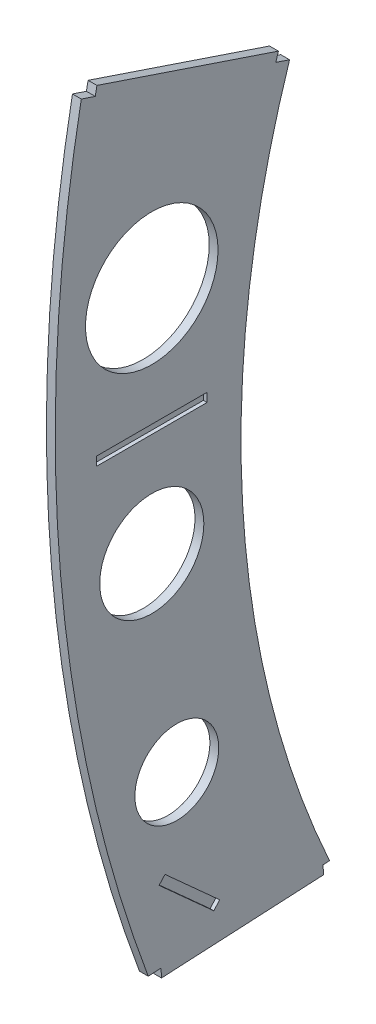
ISO-10303-21;
HEADER;
FILE_DESCRIPTION(('STEP AP214'),'2;1');
FILE_NAME('part.step','',(''),(''),'','','');
FILE_SCHEMA(('AUTOMOTIVE_DESIGN { 1 0 10303 214 1 1 1 1 }'));
ENDSEC;
DATA;
#1=APPLICATION_CONTEXT('core data for automotive mechanical design processes');
#2=APPLICATION_PROTOCOL_DEFINITION('international standard','automotive_design',2000,#1);
#3=PRODUCT_CONTEXT('',#1,'mechanical');
#4=PRODUCT('Part','Part','',(#3));
#5=PRODUCT_RELATED_PRODUCT_CATEGORY('part','',(#4));
#6=PRODUCT_DEFINITION_FORMATION('','',#4);
#7=PRODUCT_DEFINITION_CONTEXT('part definition',#1,'design');
#8=PRODUCT_DEFINITION('design','',#6,#7);
#9=PRODUCT_DEFINITION_SHAPE('','',#8);
#10=(LENGTH_UNIT() NAMED_UNIT(*) SI_UNIT(.MILLI.,.METRE.));
#11=(NAMED_UNIT(*) PLANE_ANGLE_UNIT() SI_UNIT($,.RADIAN.));
#12=(NAMED_UNIT(*) SI_UNIT($,.STERADIAN.) SOLID_ANGLE_UNIT());
#13=UNCERTAINTY_MEASURE_WITH_UNIT(LENGTH_MEASURE(1.E-05),#10,'distance_accuracy_value','');
#14=(GEOMETRIC_REPRESENTATION_CONTEXT(3) GLOBAL_UNCERTAINTY_ASSIGNED_CONTEXT((#13)) GLOBAL_UNIT_ASSIGNED_CONTEXT((#10,
#11,#12)) REPRESENTATION_CONTEXT('',''));
#15=CARTESIAN_POINT('',(0.,0.,0.));
#16=DIRECTION('',(0.,0.,1.));
#17=DIRECTION('',(1.,0.,0.));
#18=AXIS2_PLACEMENT_3D('',#15,#16,#17);
#19=CARTESIAN_POINT('',(7.,-980.120094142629,-110.473803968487));
#20=DIRECTION('',(0.,0.669721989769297,0.74261191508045));
#21=DIRECTION('',(0.,-0.74261191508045,0.669721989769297));
#22=AXIS2_PLACEMENT_3D('',#19,#20,#21);
#23=PLANE('',#22);
#24=DIRECTION('',(0.,0.742611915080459,-0.669721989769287));
#25=VECTOR('',#24,1.);
#26=CARTESIAN_POINT('',(7.,-989.031437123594,-102.437140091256));
#27=LINE('',#26,#25);
#28=CARTESIAN_POINT('',(7.,-989.031437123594,-102.437140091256));
#29=VERTEX_POINT('',#28);
#30=CARTESIAN_POINT('',(7.,-980.120094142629,-110.473803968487));
#31=VERTEX_POINT('',#30);
#32=EDGE_CURVE('E183',#29,#31,#27,.T.);
#33=ORIENTED_EDGE('',*,*,#32,.T.);
#34=DIRECTION('',(-1.,0.,0.));
#35=VECTOR('',#34,1.);
#36=CARTESIAN_POINT('',(7.,-980.120094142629,-110.473803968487));
#37=LINE('',#36,#35);
#38=CARTESIAN_POINT('',(12.,-980.120094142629,-110.473803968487));
#39=VERTEX_POINT('',#38);
#40=EDGE_CURVE('E169',#39,#31,#37,.T.);
#41=ORIENTED_EDGE('',*,*,#40,.F.);
#42=DIRECTION('',(0.,0.74261191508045,-0.669721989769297));
#43=VECTOR('',#42,1.);
#44=CARTESIAN_POINT('',(12.,-10.877783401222,-984.581633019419));
#45=LINE('',#44,#43);
#46=CARTESIAN_POINT('',(12.,-989.031437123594,-102.437140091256));
#47=VERTEX_POINT('',#46);
#48=EDGE_CURVE('E198',#47,#39,#45,.T.);
#49=ORIENTED_EDGE('',*,*,#48,.F.);
#50=DIRECTION('',(-1.,0.,0.));
#51=VECTOR('',#50,1.);
#52=CARTESIAN_POINT('',(7.,-989.031437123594,-102.437140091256));
#53=LINE('',#52,#51);
#54=EDGE_CURVE('E184',#47,#29,#53,.T.);
#55=ORIENTED_EDGE('',*,*,#54,.T.);
#56=EDGE_LOOP('',(#33,#41,#49,#55));
#57=FACE_BOUND('',#56,.T.);
#58=ADVANCED_FACE('F33',(#57),#23,.F.);
#59=CARTESIAN_POINT('',(7.,-989.031437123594,-102.437140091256));
#60=DIRECTION('',(0.,-0.742611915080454,0.669721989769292));
#61=DIRECTION('',(0.,-0.669721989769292,-0.742611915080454));
#62=AXIS2_PLACEMENT_3D('',#59,#60,#61);
#63=PLANE('',#62);
#64=DIRECTION('',(0.,0.669721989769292,0.742611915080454));
#65=VECTOR('',#64,1.);
#66=CARTESIAN_POINT('',(7.,-1056.00363610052,-176.698331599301));
#67=LINE('',#66,#65);
#68=CARTESIAN_POINT('',(7.,-1056.00363610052,-176.698331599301));
#69=VERTEX_POINT('',#68);
#70=EDGE_CURVE('E48',#69,#29,#67,.T.);
#71=ORIENTED_EDGE('',*,*,#70,.T.);
#72=ORIENTED_EDGE('',*,*,#54,.F.);
#73=DIRECTION('',(0.,0.669721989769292,0.742611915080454));
#74=VECTOR('',#73,1.);
#75=CARTESIAN_POINT('',(12.,-1499.71342124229,-668.699756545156));
#76=LINE('',#75,#74);
#77=CARTESIAN_POINT('',(12.,-1056.00363610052,-176.698331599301));
#78=VERTEX_POINT('',#77);
#79=EDGE_CURVE('E195',#78,#47,#76,.T.);
#80=ORIENTED_EDGE('',*,*,#79,.F.);
#81=DIRECTION('',(-1.,0.,0.));
#82=VECTOR('',#81,1.);
#83=CARTESIAN_POINT('',(7.,-1056.00363610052,-176.698331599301));
#84=LINE('',#83,#82);
#85=EDGE_CURVE('E223',#78,#69,#84,.T.);
#86=ORIENTED_EDGE('',*,*,#85,.T.);
#87=EDGE_LOOP('',(#71,#72,#80,#86));
#88=FACE_BOUND('',#87,.T.);
#89=ADVANCED_FACE('F408',(#88),#63,.F.);
#90=CARTESIAN_POINT('',(7.,-1047.09229311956,-184.734995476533));
#91=DIRECTION('',(0.,-0.66972198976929,-0.742611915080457));
#92=DIRECTION('',(0.,0.742611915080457,-0.66972198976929));
#93=AXIS2_PLACEMENT_3D('',#90,#91,#92);
#94=PLANE('',#93);
#95=DIRECTION('',(0.,-0.742611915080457,0.66972198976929));
#96=VECTOR('',#95,1.);
#97=CARTESIAN_POINT('',(7.,-1047.09229311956,-184.734995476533));
#98=LINE('',#97,#96);
#99=CARTESIAN_POINT('',(7.,-1047.09229311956,-184.734995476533));
#100=VERTEX_POINT('',#99);
#101=EDGE_CURVE('E56',#100,#69,#98,.T.);
#102=ORIENTED_EDGE('',*,*,#101,.T.);
#103=ORIENTED_EDGE('',*,*,#85,.F.);
#104=DIRECTION('',(0.,-0.742611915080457,0.66972198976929));
#105=VECTOR('',#104,1.);
#106=CARTESIAN_POINT('',(12.,-77.8499823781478,-1058.84282452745));
#107=LINE('',#106,#105);
#108=CARTESIAN_POINT('',(12.,-1047.09229311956,-184.734995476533));
#109=VERTEX_POINT('',#108);
#110=EDGE_CURVE('E186',#109,#78,#107,.T.);
#111=ORIENTED_EDGE('',*,*,#110,.F.);
#112=DIRECTION('',(-1.,0.,0.));
#113=VECTOR('',#112,1.);
#114=CARTESIAN_POINT('',(7.,-1047.09229311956,-184.734995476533));
#115=LINE('',#114,#113);
#116=EDGE_CURVE('E179',#109,#100,#115,.T.);
#117=ORIENTED_EDGE('',*,*,#116,.T.);
#118=EDGE_LOOP('',(#102,#103,#111,#117));
#119=FACE_BOUND('',#118,.T.);
#120=ADVANCED_FACE('F413',(#119),#94,.F.);
#121=CARTESIAN_POINT('',(7.,-1047.09229311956,-184.734995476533));
#122=DIRECTION('',(0.,0.742611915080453,-0.669721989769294));
#123=DIRECTION('',(0.,0.669721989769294,0.742611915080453));
#124=AXIS2_PLACEMENT_3D('',#121,#122,#123);
#125=PLANE('',#124);
#126=DIRECTION('',(0.,-0.669721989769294,-0.742611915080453));
#127=VECTOR('',#126,1.);
#128=CARTESIAN_POINT('',(7.,-980.120094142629,-110.473803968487));
#129=LINE('',#128,#127);
#130=EDGE_CURVE('E173',#31,#100,#129,.T.);
#131=ORIENTED_EDGE('',*,*,#130,.T.);
#132=ORIENTED_EDGE('',*,*,#116,.F.);
#133=DIRECTION('',(0.,-0.669721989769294,-0.742611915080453));
#134=VECTOR('',#133,1.);
#135=CARTESIAN_POINT('',(12.,-1490.80207826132,-676.736420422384));
#136=LINE('',#135,#134);
#137=EDGE_CURVE('E175',#39,#109,#136,.T.);
#138=ORIENTED_EDGE('',*,*,#137,.F.);
#139=ORIENTED_EDGE('',*,*,#40,.T.);
#140=EDGE_LOOP('',(#131,#132,#138,#139));
#141=FACE_BOUND('',#140,.T.);
#142=ADVANCED_FACE('F171',(#141),#125,.F.);
#143=CARTESIAN_POINT('',(7.,-441.731689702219,-167.514629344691));
#144=DIRECTION('',(0.,0.,-1.));
#145=DIRECTION('',(-1.,0.,0.));
#146=AXIS2_PLACEMENT_3D('',#143,#144,#145);
#147=PLANE('',#146);
#148=DIRECTION('',(0.,-1.,0.));
#149=VECTOR('',#148,1.);
#150=CARTESIAN_POINT('',(7.,-441.731689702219,-167.514629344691));
#151=LINE('',#150,#149);
#152=CARTESIAN_POINT('',(7.,-441.731689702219,-167.514629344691));
#153=VERTEX_POINT('',#152);
#154=CARTESIAN_POINT('',(7.,-453.731689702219,-167.514629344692));
#155=VERTEX_POINT('',#154);
#156=EDGE_CURVE('E203',#153,#155,#151,.T.);
#157=ORIENTED_EDGE('',*,*,#156,.T.);
#158=DIRECTION('',(-1.,0.,0.));
#159=VECTOR('',#158,1.);
#160=CARTESIAN_POINT('',(7.,-453.731689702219,-167.514629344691));
#161=LINE('',#160,#159);
#162=CARTESIAN_POINT('',(12.,-453.731689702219,-167.514629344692));
#163=VERTEX_POINT('',#162);
#164=EDGE_CURVE('E222',#163,#155,#161,.T.);
#165=ORIENTED_EDGE('',*,*,#164,.F.);
#166=DIRECTION('',(0.,-1.,0.));
#167=VECTOR('',#166,1.);
#168=CARTESIAN_POINT('',(12.,-521.559767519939,-167.514629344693));
#169=LINE('',#168,#167);
#170=CARTESIAN_POINT('',(12.,-441.731689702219,-167.514629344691));
#171=VERTEX_POINT('',#170);
#172=EDGE_CURVE('E210',#171,#163,#169,.T.);
#173=ORIENTED_EDGE('',*,*,#172,.F.);
#174=DIRECTION('',(-1.,0.,0.));
#175=VECTOR('',#174,1.);
#176=CARTESIAN_POINT('',(7.,-441.731689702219,-167.514629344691));
#177=LINE('',#176,#175);
#178=EDGE_CURVE('E226',#171,#153,#177,.T.);
#179=ORIENTED_EDGE('',*,*,#178,.T.);
#180=EDGE_LOOP('',(#157,#165,#173,#179));
#181=FACE_BOUND('',#180,.T.);
#182=ADVANCED_FACE('F422',(#181),#147,.F.);
#183=CARTESIAN_POINT('',(7.,-441.731689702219,-167.514629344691));
#184=DIRECTION('',(0.,1.,0.));
#185=DIRECTION('',(0.,0.,1.));
#186=AXIS2_PLACEMENT_3D('',#183,#184,#185);
#187=PLANE('',#186);
#188=DIRECTION('',(0.,0.,-1.));
#189=VECTOR('',#188,1.);
#190=CARTESIAN_POINT('',(7.,-441.731689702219,-17.5146293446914));
#191=LINE('',#190,#189);
#192=CARTESIAN_POINT('',(7.,-441.731689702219,-17.5146293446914));
#193=VERTEX_POINT('',#192);
#194=EDGE_CURVE('E201',#193,#153,#191,.T.);
#195=ORIENTED_EDGE('',*,*,#194,.T.);
#196=ORIENTED_EDGE('',*,*,#178,.F.);
#197=DIRECTION('',(0.,0.,-1.));
#198=VECTOR('',#197,1.);
#199=CARTESIAN_POINT('',(12.,-441.731689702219,-1550.84424947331));
#200=LINE('',#199,#198);
#201=CARTESIAN_POINT('',(12.,-441.731689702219,-17.5146293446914));
#202=VERTEX_POINT('',#201);
#203=EDGE_CURVE('E180',#202,#171,#200,.T.);
#204=ORIENTED_EDGE('',*,*,#203,.F.);
#205=DIRECTION('',(-1.,0.,0.));
#206=VECTOR('',#205,1.);
#207=CARTESIAN_POINT('',(7.,-441.731689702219,-17.5146293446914));
#208=LINE('',#207,#206);
#209=EDGE_CURVE('E230',#202,#193,#208,.T.);
#210=ORIENTED_EDGE('',*,*,#209,.T.);
#211=EDGE_LOOP('',(#195,#196,#204,#210));
#212=FACE_BOUND('',#211,.T.);
#213=ADVANCED_FACE('F418',(#212),#187,.F.);
#214=CARTESIAN_POINT('',(7.,-441.731689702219,-17.5146293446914));
#215=DIRECTION('',(0.,0.,1.));
#216=DIRECTION('',(1.,0.,0.));
#217=AXIS2_PLACEMENT_3D('',#214,#215,#216);
#218=PLANE('',#217);
#219=DIRECTION('',(0.,1.,0.));
#220=VECTOR('',#219,1.);
#221=CARTESIAN_POINT('',(7.,-453.731689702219,-17.5146293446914));
#222=LINE('',#221,#220);
#223=CARTESIAN_POINT('',(7.,-453.731689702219,-17.5146293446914));
#224=VERTEX_POINT('',#223);
#225=EDGE_CURVE('E208',#224,#193,#222,.T.);
#226=ORIENTED_EDGE('',*,*,#225,.T.);
#227=ORIENTED_EDGE('',*,*,#209,.F.);
#228=DIRECTION('',(0.,1.,0.));
#229=VECTOR('',#228,1.);
#230=CARTESIAN_POINT('',(12.,-521.559767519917,-17.5146293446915));
#231=LINE('',#230,#229);
#232=CARTESIAN_POINT('',(12.,-453.731689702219,-17.5146293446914));
#233=VERTEX_POINT('',#232);
#234=EDGE_CURVE('E216',#233,#202,#231,.T.);
#235=ORIENTED_EDGE('',*,*,#234,.F.);
#236=DIRECTION('',(-1.,0.,0.));
#237=VECTOR('',#236,1.);
#238=CARTESIAN_POINT('',(7.,-453.731689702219,-17.5146293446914));
#239=LINE('',#238,#237);
#240=EDGE_CURVE('E233',#233,#224,#239,.T.);
#241=ORIENTED_EDGE('',*,*,#240,.T.);
#242=EDGE_LOOP('',(#226,#227,#235,#241));
#243=FACE_BOUND('',#242,.T.);
#244=ADVANCED_FACE('F421',(#243),#218,.F.);
#245=CARTESIAN_POINT('',(7.,-453.731689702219,-167.514629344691));
#246=DIRECTION('',(0.,-1.,0.));
#247=DIRECTION('',(0.,0.,-1.));
#248=AXIS2_PLACEMENT_3D('',#245,#246,#247);
#249=PLANE('',#248);
#250=DIRECTION('',(0.,0.,1.));
#251=VECTOR('',#250,1.);
#252=CARTESIAN_POINT('',(7.,-453.731689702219,-167.514629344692));
#253=LINE('',#252,#251);
#254=EDGE_CURVE('E206',#155,#224,#253,.T.);
#255=ORIENTED_EDGE('',*,*,#254,.T.);
#256=ORIENTED_EDGE('',*,*,#240,.F.);
#257=DIRECTION('',(0.,0.,1.));
#258=VECTOR('',#257,1.);
#259=CARTESIAN_POINT('',(12.,-453.731689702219,-1550.84424947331));
#260=LINE('',#259,#258);
#261=EDGE_CURVE('E213',#163,#233,#260,.T.);
#262=ORIENTED_EDGE('',*,*,#261,.F.);
#263=ORIENTED_EDGE('',*,*,#164,.T.);
#264=EDGE_LOOP('',(#255,#256,#262,#263));
#265=FACE_BOUND('',#264,.T.);
#266=ADVANCED_FACE('F426',(#265),#249,.F.);
#267=CARTESIAN_POINT('',(12.,-386.92843178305,-1973.74746697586));
#268=DIRECTION('',(-1.,0.,0.));
#269=DIRECTION('',(0.,0.,1.));
#270=AXIS2_PLACEMENT_3D('',#267,#268,#269);
#271=CYLINDRICAL_SURFACE('',#270,2012.30376542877);
#272=DIRECTION('',(-1.,0.,0.));
#273=VECTOR('',#272,1.);
#274=CARTESIAN_POINT('',(25.,-1088.46656554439,-87.6905507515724));
#275=LINE('',#274,#273);
#276=CARTESIAN_POINT('',(12.,-1088.46656554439,-87.6905507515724));
#277=VERTEX_POINT('',#276);
#278=CARTESIAN_POINT('',(0.,-1088.46656554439,-87.6905507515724));
#279=VERTEX_POINT('',#278);
#280=EDGE_CURVE('E243',#277,#279,#275,.T.);
#281=ORIENTED_EDGE('',*,*,#280,.F.);
#282=CARTESIAN_POINT('',(12.,-386.92843178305,-1973.74746697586));
#283=DIRECTION('',(1.,0.,0.));
#284=DIRECTION('',(0.,0.,-1.));
#285=AXIS2_PLACEMENT_3D('',#282,#283,#284);
#286=CIRCLE('',#285,2012.30376542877);
#287=CARTESIAN_POINT('',(12.,-11.4650132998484,3.21830555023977));
#288=VERTEX_POINT('',#287);
#289=EDGE_CURVE('E285',#288,#277,#286,.T.);
#290=ORIENTED_EDGE('',*,*,#289,.F.);
#291=DIRECTION('',(-1.,0.,0.));
#292=VECTOR('',#291,1.);
#293=CARTESIAN_POINT('',(12.,-11.4650132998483,3.21830555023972));
#294=LINE('',#293,#292);
#295=CARTESIAN_POINT('',(0.,-11.4650132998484,3.21830555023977));
#296=VERTEX_POINT('',#295);
#297=EDGE_CURVE('E283',#288,#296,#294,.T.);
#298=ORIENTED_EDGE('',*,*,#297,.T.);
#299=CARTESIAN_POINT('',(0.,-386.92843178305,-1973.74746697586));
#300=DIRECTION('',(1.,0.,0.));
#301=DIRECTION('',(0.,0.,-1.));
#302=AXIS2_PLACEMENT_3D('',#299,#300,#301);
#303=CIRCLE('',#302,2012.30376542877);
#304=EDGE_CURVE('E280',#296,#279,#303,.T.);
#305=ORIENTED_EDGE('',*,*,#304,.T.);
#306=EDGE_LOOP('',(#281,#290,#298,#305));
#307=FACE_BOUND('',#306,.T.);
#308=ADVANCED_FACE('F387',(#307),#271,.T.);
#309=CARTESIAN_POINT('',(12.,-521.559767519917,-1550.84424947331));
#310=DIRECTION('',(-1.,0.,0.));
#311=DIRECTION('',(0.,0.,1.));
#312=AXIS2_PLACEMENT_3D('',#309,#310,#311);
#313=PLANE('',#312);
#314=ORIENTED_EDGE('',*,*,#48,.T.);
#315=ORIENTED_EDGE('',*,*,#137,.T.);
#316=ORIENTED_EDGE('',*,*,#110,.T.);
#317=ORIENTED_EDGE('',*,*,#79,.T.);
#318=EDGE_LOOP('',(#314,#315,#316,#317));
#319=FACE_BOUND('',#318,.T.);
#320=ORIENTED_EDGE('',*,*,#234,.T.);
#321=ORIENTED_EDGE('',*,*,#203,.T.);
#322=ORIENTED_EDGE('',*,*,#172,.T.);
#323=ORIENTED_EDGE('',*,*,#261,.T.);
#324=EDGE_LOOP('',(#320,#321,#322,#323));
#325=FACE_BOUND('',#324,.T.);
#326=CARTESIAN_POINT('',(12.,-281.747595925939,-92.5146293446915));
#327=DIRECTION('',(1.,0.,0.));
#328=DIRECTION('',(0.,0.,-1.));
#329=AXIS2_PLACEMENT_3D('',#326,#327,#328);
#330=CIRCLE('',#329,89.9840937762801);
#331=CARTESIAN_POINT('',(12.,-281.747595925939,-182.498723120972));
#332=VERTEX_POINT('',#331);
#333=EDGE_CURVE('E310',#332,#332,#330,.T.);
#334=ORIENTED_EDGE('',*,*,#333,.F.);
#335=EDGE_LOOP('',(#334));
#336=FACE_BOUND('',#335,.T.);
#337=CARTESIAN_POINT('',(12.,-593.878965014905,-92.5146293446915));
#338=DIRECTION('',(1.,0.,0.));
#339=DIRECTION('',(0.,0.,-1.));
#340=AXIS2_PLACEMENT_3D('',#337,#338,#339);
#341=CIRCLE('',#340,70.6940300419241);
#342=CARTESIAN_POINT('',(12.,-593.878965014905,-163.208659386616));
#343=VERTEX_POINT('',#342);
#344=EDGE_CURVE('E306',#343,#343,#341,.T.);
#345=ORIENTED_EDGE('',*,*,#344,.F.);
#346=EDGE_LOOP('',(#345));
#347=FACE_BOUND('',#346,.T.);
#348=CARTESIAN_POINT('',(12.,-867.825114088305,-126.500771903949));
#349=DIRECTION('',(1.,0.,0.));
#350=DIRECTION('',(0.,0.,-1.));
#351=AXIS2_PLACEMENT_3D('',#348,#349,#350);
#352=CIRCLE('',#351,56.9336513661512);
#353=CARTESIAN_POINT('',(12.,-867.825114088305,-183.4344232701));
#354=VERTEX_POINT('',#353);
#355=EDGE_CURVE('E302',#354,#354,#352,.T.);
#356=ORIENTED_EDGE('',*,*,#355,.F.);
#357=EDGE_LOOP('',(#356));
#358=FACE_BOUND('',#357,.T.);
#359=DIRECTION('',(0.,-0.0515409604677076,0.998670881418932));
#360=VECTOR('',#359,1.);
#361=CARTESIAN_POINT('',(12.,-1011.6484793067,-1576.1375101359));
#362=LINE('',#361,#360);
#363=CARTESIAN_POINT('',(12.,-1087.56789574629,-105.103407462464));
#364=VERTEX_POINT('',#363);
#365=EDGE_CURVE('E248',#364,#277,#362,.T.);
#366=ORIENTED_EDGE('',*,*,#365,.F.);
#367=DIRECTION('',(0.,0.998670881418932,0.0515409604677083));
#368=VECTOR('',#367,1.);
#369=CARTESIAN_POINT('',(12.,-597.479183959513,-79.8101467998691));
#370=LINE('',#369,#368);
#371=CARTESIAN_POINT('',(12.,-1099.5678957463,-105.72272213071));
#372=VERTEX_POINT('',#371);
#373=EDGE_CURVE('E245',#372,#364,#370,.T.);
#374=ORIENTED_EDGE('',*,*,#373,.F.);
#375=DIRECTION('',(0.,0.0515409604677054,-0.998670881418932));
#376=VECTOR('',#375,1.);
#377=CARTESIAN_POINT('',(12.,-1023.6484793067,-1576.75682480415));
#378=LINE('',#377,#376);
#379=CARTESIAN_POINT('',(12.,-1088.21379349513,-325.722722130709));
#380=VERTEX_POINT('',#379);
#381=EDGE_CURVE('E268',#372,#380,#378,.T.);
#382=ORIENTED_EDGE('',*,*,#381,.T.);
#383=DIRECTION('',(0.,0.998670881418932,0.0515409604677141));
#384=VECTOR('',#383,1.);
#385=CARTESIAN_POINT('',(12.,-586.125081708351,-299.810146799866));
#386=LINE('',#385,#384);
#387=CARTESIAN_POINT('',(12.,-1076.21379349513,-325.103407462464));
#388=VERTEX_POINT('',#387);
#389=EDGE_CURVE('E259',#380,#388,#386,.T.);
#390=ORIENTED_EDGE('',*,*,#389,.T.);
#391=DIRECTION('',(0.,0.0515409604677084,-0.998670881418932));
#392=VECTOR('',#391,1.);
#393=CARTESIAN_POINT('',(12.,-1011.6484793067,-1576.1375101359));
#394=LINE('',#393,#392);
#395=CARTESIAN_POINT('',(12.,-1075.75972176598,-333.901617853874));
#396=VERTEX_POINT('',#395);
#397=EDGE_CURVE('E263',#388,#396,#394,.T.);
#398=ORIENTED_EDGE('',*,*,#397,.T.);
#399=CARTESIAN_POINT('',(12.,-521.559767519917,-1550.84424947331));
#400=DIRECTION('',(-1.,0.,0.));
#401=DIRECTION('',(0.,0.,1.));
#402=AXIS2_PLACEMENT_3D('',#399,#400,#401);
#403=CIRCLE('',#402,1337.19368751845);
#404=CARTESIAN_POINT('',(12.,-106.69780076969,-279.633603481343));
#405=VERTEX_POINT('',#404);
#406=EDGE_CURVE('E314',#396,#405,#403,.T.);
#407=ORIENTED_EDGE('',*,*,#406,.T.);
#408=DIRECTION('',(0.,-0.318763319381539,-0.947834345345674));
#409=VECTOR('',#408,1.);
#410=CARTESIAN_POINT('',(12.,-100.416845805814,-260.95734911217));
#411=LINE('',#410,#409);
#412=CARTESIAN_POINT('',(12.,-100.416845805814,-260.95734911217));
#413=VERTEX_POINT('',#412);
#414=EDGE_CURVE('E279',#413,#405,#411,.T.);
#415=ORIENTED_EDGE('',*,*,#414,.F.);
#416=DIRECTION('',(0.,-0.956720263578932,0.291009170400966));
#417=VECTOR('',#416,1.);
#418=CARTESIAN_POINT('',(12.,-88.9362026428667,-264.449459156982));
#419=LINE('',#418,#417);
#420=CARTESIAN_POINT('',(12.,-88.9362026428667,-264.449459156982));
#421=VERTEX_POINT('',#420);
#422=EDGE_CURVE('E331',#421,#413,#419,.T.);
#423=ORIENTED_EDGE('',*,*,#422,.F.);
#424=DIRECTION('',(0.,0.318763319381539,0.947834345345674));
#425=VECTOR('',#424,1.);
#426=CARTESIAN_POINT('',(12.,0.317526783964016,0.944157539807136));
#427=LINE('',#426,#425);
#428=CARTESIAN_POINT('',(12.,-6.05773960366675,-18.0125293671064));
#429=VERTEX_POINT('',#428);
#430=EDGE_CURVE('E289',#421,#429,#427,.T.);
#431=ORIENTED_EDGE('',*,*,#430,.T.);
#432=DIRECTION('',(0.,0.981878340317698,-0.189512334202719));
#433=VECTOR('',#432,1.);
#434=CARTESIAN_POINT('',(12.,-6.05773960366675,-18.0125293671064));
#435=LINE('',#434,#433);
#436=CARTESIAN_POINT('',(12.,-17.8402796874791,-15.7383813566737));
#437=VERTEX_POINT('',#436);
#438=EDGE_CURVE('E275',#437,#429,#435,.T.);
#439=ORIENTED_EDGE('',*,*,#438,.F.);
#440=DIRECTION('',(0.,-0.318763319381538,-0.947834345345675));
#441=VECTOR('',#440,1.);
#442=CARTESIAN_POINT('',(12.,-17.8402796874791,-15.7383813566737));
#443=LINE('',#442,#441);
#444=EDGE_CURVE('E290',#288,#437,#443,.T.);
#445=ORIENTED_EDGE('',*,*,#444,.F.);
#446=ORIENTED_EDGE('',*,*,#289,.T.);
#447=EDGE_LOOP('',(#366,#374,#382,#390,#398,#407,#415,#423,#431,#439,#445,#446));
#448=FACE_BOUND('',#447,.T.);
#449=ADVANCED_FACE('F363',(#319,#325,#336,#347,#358,#448),#313,.F.);
#450=CARTESIAN_POINT('',(0.,-521.559767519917,-1550.84424947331));
#451=DIRECTION('',(-1.,0.,0.));
#452=DIRECTION('',(0.,0.,1.));
#453=AXIS2_PLACEMENT_3D('',#450,#451,#452);
#454=PLANE('',#453);
#455=CARTESIAN_POINT('',(0.,-867.825114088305,-126.500771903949));
#456=DIRECTION('',(-1.,0.,0.));
#457=DIRECTION('',(0.,0.,1.));
#458=AXIS2_PLACEMENT_3D('',#455,#456,#457);
#459=CIRCLE('',#458,56.9336513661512);
#460=CARTESIAN_POINT('',(0.,-867.825114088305,-69.5671205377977));
#461=VERTEX_POINT('',#460);
#462=EDGE_CURVE('E305',#461,#461,#459,.T.);
#463=ORIENTED_EDGE('',*,*,#462,.F.);
#464=EDGE_LOOP('',(#463));
#465=FACE_BOUND('',#464,.T.);
#466=CARTESIAN_POINT('',(0.,-593.878965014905,-92.5146293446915));
#467=DIRECTION('',(-1.,0.,0.));
#468=DIRECTION('',(0.,0.,1.));
#469=AXIS2_PLACEMENT_3D('',#466,#467,#468);
#470=CIRCLE('',#469,70.6940300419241);
#471=CARTESIAN_POINT('',(0.,-593.878965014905,-21.8205993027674));
#472=VERTEX_POINT('',#471);
#473=EDGE_CURVE('E309',#472,#472,#470,.T.);
#474=ORIENTED_EDGE('',*,*,#473,.F.);
#475=EDGE_LOOP('',(#474));
#476=FACE_BOUND('',#475,.T.);
#477=CARTESIAN_POINT('',(0.,-281.747595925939,-92.5146293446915));
#478=DIRECTION('',(-1.,0.,0.));
#479=DIRECTION('',(0.,0.,1.));
#480=AXIS2_PLACEMENT_3D('',#477,#478,#479);
#481=CIRCLE('',#480,89.9840937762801);
#482=CARTESIAN_POINT('',(0.,-281.747595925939,-2.53053556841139));
#483=VERTEX_POINT('',#482);
#484=EDGE_CURVE('E288',#483,#483,#481,.T.);
#485=ORIENTED_EDGE('',*,*,#484,.F.);
#486=EDGE_LOOP('',(#485));
#487=FACE_BOUND('',#486,.T.);
#488=DIRECTION('',(0.,0.998670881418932,0.0515409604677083));
#489=VECTOR('',#488,1.);
#490=CARTESIAN_POINT('',(0.,2.52083841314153,-48.8444122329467));
#491=LINE('',#490,#489);
#492=CARTESIAN_POINT('',(0.,-1099.5678957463,-105.72272213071));
#493=VERTEX_POINT('',#492);
#494=CARTESIAN_POINT('',(0.,-1087.56789574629,-105.103407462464));
#495=VERTEX_POINT('',#494);
#496=EDGE_CURVE('E239',#493,#495,#491,.T.);
#497=ORIENTED_EDGE('',*,*,#496,.T.);
#498=DIRECTION('',(0.,-0.0515409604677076,0.998670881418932));
#499=VECTOR('',#498,1.);
#500=CARTESIAN_POINT('',(0.,-1090.08873415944,-56.2589952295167));
#501=LINE('',#500,#499);
#502=EDGE_CURVE('E229',#495,#279,#501,.T.);
#503=ORIENTED_EDGE('',*,*,#502,.T.);
#504=ORIENTED_EDGE('',*,*,#304,.F.);
#505=DIRECTION('',(0.,0.318763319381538,0.947834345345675));
#506=VECTOR('',#505,1.);
#507=CARTESIAN_POINT('',(0.,-532.832182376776,-1547.05325751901));
#508=LINE('',#507,#506);
#509=CARTESIAN_POINT('',(0.,-17.840279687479,-15.7383813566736));
#510=VERTEX_POINT('',#509);
#511=EDGE_CURVE('E294',#510,#296,#508,.T.);
#512=ORIENTED_EDGE('',*,*,#511,.F.);
#513=DIRECTION('',(0.,-0.981878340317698,0.189512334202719));
#514=VECTOR('',#513,1.);
#515=CARTESIAN_POINT('',(0.,-217.819204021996,22.8595499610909));
#516=LINE('',#515,#514);
#517=CARTESIAN_POINT('',(0.,-6.05773960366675,-18.0125293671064));
#518=VERTEX_POINT('',#517);
#519=EDGE_CURVE('E293',#518,#510,#516,.T.);
#520=ORIENTED_EDGE('',*,*,#519,.F.);
#521=DIRECTION('',(0.,0.318763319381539,0.947834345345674));
#522=VECTOR('',#521,1.);
#523=CARTESIAN_POINT('',(0.,0.317526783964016,0.944157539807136));
#524=LINE('',#523,#522);
#525=CARTESIAN_POINT('',(0.,-88.9362026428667,-264.449459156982));
#526=VERTEX_POINT('',#525);
#527=EDGE_CURVE('E300',#526,#518,#524,.T.);
#528=ORIENTED_EDGE('',*,*,#527,.F.);
#529=DIRECTION('',(0.,0.956720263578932,-0.291009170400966));
#530=VECTOR('',#529,1.);
#531=CARTESIAN_POINT('',(0.,-126.771667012,-252.940904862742));
#532=LINE('',#531,#530);
#533=CARTESIAN_POINT('',(0.,-100.416845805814,-260.95734911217));
#534=VERTEX_POINT('',#533);
#535=EDGE_CURVE('E276',#534,#526,#532,.T.);
#536=ORIENTED_EDGE('',*,*,#535,.F.);
#537=DIRECTION('',(0.,0.318763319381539,0.947834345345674));
#538=VECTOR('',#537,1.);
#539=CARTESIAN_POINT('',(0.,-532.928949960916,-1547.02071390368));
#540=LINE('',#539,#538);
#541=CARTESIAN_POINT('',(0.,-106.69780076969,-279.633603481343));
#542=VERTEX_POINT('',#541);
#543=EDGE_CURVE('E271',#542,#534,#540,.T.);
#544=ORIENTED_EDGE('',*,*,#543,.F.);
#545=CARTESIAN_POINT('',(0.,-521.559767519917,-1550.84424947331));
#546=DIRECTION('',(-1.,0.,0.));
#547=DIRECTION('',(0.,0.,1.));
#548=AXIS2_PLACEMENT_3D('',#545,#546,#547);
#549=CIRCLE('',#548,1337.19368751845);
#550=CARTESIAN_POINT('',(0.,-1075.75972176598,-333.901617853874));
#551=VERTEX_POINT('',#550);
#552=EDGE_CURVE('E270',#551,#542,#549,.T.);
#553=ORIENTED_EDGE('',*,*,#552,.F.);
#554=DIRECTION('',(0.,0.0515409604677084,-0.998670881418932));
#555=VECTOR('',#554,1.);
#556=CARTESIAN_POINT('',(0.,-1090.08873415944,-56.2589952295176));
#557=LINE('',#556,#555);
#558=CARTESIAN_POINT('',(0.,-1076.21379349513,-325.103407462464));
#559=VERTEX_POINT('',#558);
#560=EDGE_CURVE('E253',#559,#551,#557,.T.);
#561=ORIENTED_EDGE('',*,*,#560,.F.);
#562=DIRECTION('',(0.,0.998670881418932,0.0515409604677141));
#563=VECTOR('',#562,1.);
#564=CARTESIAN_POINT('',(0.,13.874940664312,-268.84441223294));
#565=LINE('',#564,#563);
#566=CARTESIAN_POINT('',(0.,-1088.21379349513,-325.72272213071));
#567=VERTEX_POINT('',#566);
#568=EDGE_CURVE('E250',#567,#559,#565,.T.);
#569=ORIENTED_EDGE('',*,*,#568,.F.);
#570=DIRECTION('',(0.,0.0515409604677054,-0.998670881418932));
#571=VECTOR('',#570,1.);
#572=CARTESIAN_POINT('',(0.,-1087.51191864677,-339.322429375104));
#573=LINE('',#572,#571);
#574=EDGE_CURVE('E266',#493,#567,#573,.T.);
#575=ORIENTED_EDGE('',*,*,#574,.F.);
#576=EDGE_LOOP('',(#497,#503,#504,#512,#520,#528,#536,#544,#553,#561,#569,#575));
#577=FACE_BOUND('',#576,.T.);
#578=ADVANCED_FACE('F352',(#465,#476,#487,#577),#454,.T.);
#579=CARTESIAN_POINT('',(25.,-1087.51191864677,-339.322429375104));
#580=DIRECTION('',(0.,0.998670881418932,0.0515409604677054));
#581=DIRECTION('',(0.,-0.0515409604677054,0.998670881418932));
#582=AXIS2_PLACEMENT_3D('',#579,#580,#581);
#583=PLANE('',#582);
#584=DIRECTION('',(1.,0.,0.));
#585=VECTOR('',#584,1.);
#586=CARTESIAN_POINT('',(25.,-1099.5678957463,-105.72272213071));
#587=LINE('',#586,#585);
#588=EDGE_CURVE('E11',#493,#372,#587,.T.);
#589=ORIENTED_EDGE('',*,*,#588,.F.);
#590=ORIENTED_EDGE('',*,*,#574,.T.);
#591=DIRECTION('',(1.,0.,0.));
#592=VECTOR('',#591,1.);
#593=CARTESIAN_POINT('',(25.,-1088.21379349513,-325.72272213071));
#594=LINE('',#593,#592);
#595=EDGE_CURVE('E41',#567,#380,#594,.T.);
#596=ORIENTED_EDGE('',*,*,#595,.T.);
#597=ORIENTED_EDGE('',*,*,#381,.F.);
#598=EDGE_LOOP('',(#589,#590,#596,#597));
#599=FACE_BOUND('',#598,.T.);
#600=ADVANCED_FACE('F343',(#599),#583,.F.);
#601=CARTESIAN_POINT('',(12.,-521.559767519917,-1550.84424947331));
#602=DIRECTION('',(-1.,0.,0.));
#603=DIRECTION('',(0.,0.,1.));
#604=AXIS2_PLACEMENT_3D('',#601,#602,#603);
#605=CYLINDRICAL_SURFACE('',#604,1337.19368751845);
#606=ORIENTED_EDGE('',*,*,#406,.F.);
#607=DIRECTION('',(-1.,0.,0.));
#608=VECTOR('',#607,1.);
#609=CARTESIAN_POINT('',(25.,-1075.75972176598,-333.901617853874));
#610=LINE('',#609,#608);
#611=EDGE_CURVE('E256',#396,#551,#610,.T.);
#612=ORIENTED_EDGE('',*,*,#611,.T.);
#613=ORIENTED_EDGE('',*,*,#552,.T.);
#614=DIRECTION('',(-1.,0.,0.));
#615=VECTOR('',#614,1.);
#616=CARTESIAN_POINT('',(12.,-106.69780076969,-279.633603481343));
#617=LINE('',#616,#615);
#618=EDGE_CURVE('E316',#542,#405,#617,.F.);
#619=ORIENTED_EDGE('',*,*,#618,.T.);
#620=EDGE_LOOP('',(#606,#612,#613,#619));
#621=FACE_BOUND('',#620,.T.);
#622=ADVANCED_FACE('F35',(#621),#605,.F.);
#623=CARTESIAN_POINT('',(12.,0.317526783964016,0.944157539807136));
#624=DIRECTION('',(0.,-0.947834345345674,0.318763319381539));
#625=DIRECTION('',(0.,-0.318763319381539,-0.947834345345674));
#626=AXIS2_PLACEMENT_3D('',#623,#624,#625);
#627=PLANE('',#626);
#628=ORIENTED_EDGE('',*,*,#430,.F.);
#629=DIRECTION('',(1.,0.,0.));
#630=VECTOR('',#629,1.);
#631=CARTESIAN_POINT('',(-2.,-88.9362026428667,-264.449459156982));
#632=LINE('',#631,#630);
#633=EDGE_CURVE('E278',#526,#421,#632,.T.);
#634=ORIENTED_EDGE('',*,*,#633,.F.);
#635=ORIENTED_EDGE('',*,*,#527,.T.);
#636=DIRECTION('',(1.,0.,0.));
#637=VECTOR('',#636,1.);
#638=CARTESIAN_POINT('',(-2.,-6.05773960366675,-18.0125293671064));
#639=LINE('',#638,#637);
#640=EDGE_CURVE('E284',#518,#429,#639,.T.);
#641=ORIENTED_EDGE('',*,*,#640,.T.);
#642=EDGE_LOOP('',(#628,#634,#635,#641));
#643=FACE_BOUND('',#642,.T.);
#644=ADVANCED_FACE('F374',(#643),#627,.F.);
#645=CARTESIAN_POINT('',(-2.,-281.747595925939,-92.5146293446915));
#646=DIRECTION('',(1.,0.,0.));
#647=DIRECTION('',(0.,0.,-1.));
#648=AXIS2_PLACEMENT_3D('',#645,#646,#647);
#649=CYLINDRICAL_SURFACE('',#648,89.9840937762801);
#650=ORIENTED_EDGE('',*,*,#484,.T.);
#651=EDGE_LOOP('',(#650));
#652=FACE_BOUND('',#651,.T.);
#653=ORIENTED_EDGE('',*,*,#333,.T.);
#654=EDGE_LOOP('',(#653));
#655=FACE_BOUND('',#654,.T.);
#656=ADVANCED_FACE('F463',(#652,#655),#649,.F.);
#657=CARTESIAN_POINT('',(-2.,-593.878965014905,-92.5146293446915));
#658=DIRECTION('',(1.,0.,0.));
#659=DIRECTION('',(0.,0.,-1.));
#660=AXIS2_PLACEMENT_3D('',#657,#658,#659);
#661=CYLINDRICAL_SURFACE('',#660,70.6940300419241);
#662=ORIENTED_EDGE('',*,*,#473,.T.);
#663=EDGE_LOOP('',(#662));
#664=FACE_BOUND('',#663,.T.);
#665=ORIENTED_EDGE('',*,*,#344,.T.);
#666=EDGE_LOOP('',(#665));
#667=FACE_BOUND('',#666,.T.);
#668=ADVANCED_FACE('F455',(#664,#667),#661,.F.);
#669=CARTESIAN_POINT('',(-2.,-867.825114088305,-126.500771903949));
#670=DIRECTION('',(1.,0.,0.));
#671=DIRECTION('',(0.,0.,-1.));
#672=AXIS2_PLACEMENT_3D('',#669,#670,#671);
#673=CYLINDRICAL_SURFACE('',#672,56.9336513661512);
#674=ORIENTED_EDGE('',*,*,#462,.T.);
#675=EDGE_LOOP('',(#674));
#676=FACE_BOUND('',#675,.T.);
#677=ORIENTED_EDGE('',*,*,#355,.T.);
#678=EDGE_LOOP('',(#677));
#679=FACE_BOUND('',#678,.T.);
#680=ADVANCED_FACE('F453',(#676,#679),#673,.F.);
#681=CARTESIAN_POINT('',(-2.,-17.8402796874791,-15.7383813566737));
#682=DIRECTION('',(0.,-0.947834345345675,0.318763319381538));
#683=DIRECTION('',(0.,-0.318763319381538,-0.947834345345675));
#684=AXIS2_PLACEMENT_3D('',#681,#682,#683);
#685=PLANE('',#684);
#686=ORIENTED_EDGE('',*,*,#511,.T.);
#687=ORIENTED_EDGE('',*,*,#297,.F.);
#688=ORIENTED_EDGE('',*,*,#444,.T.);
#689=DIRECTION('',(1.,0.,0.));
#690=VECTOR('',#689,1.);
#691=CARTESIAN_POINT('',(-2.,-17.8402796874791,-15.7383813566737));
#692=LINE('',#691,#690);
#693=EDGE_CURVE('E297',#510,#437,#692,.T.);
#694=ORIENTED_EDGE('',*,*,#693,.F.);
#695=EDGE_LOOP('',(#686,#687,#688,#694));
#696=FACE_BOUND('',#695,.T.);
#697=ADVANCED_FACE('F383',(#696),#685,.F.);
#698=CARTESIAN_POINT('',(-2.,-6.05773960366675,-18.0125293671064));
#699=DIRECTION('',(0.,-0.189512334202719,-0.981878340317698));
#700=DIRECTION('',(0.,0.981878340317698,-0.189512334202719));
#701=AXIS2_PLACEMENT_3D('',#698,#699,#700);
#702=PLANE('',#701);
#703=ORIENTED_EDGE('',*,*,#519,.T.);
#704=ORIENTED_EDGE('',*,*,#693,.T.);
#705=ORIENTED_EDGE('',*,*,#438,.T.);
#706=ORIENTED_EDGE('',*,*,#640,.F.);
#707=EDGE_LOOP('',(#703,#704,#705,#706));
#708=FACE_BOUND('',#707,.T.);
#709=ADVANCED_FACE('F379',(#708),#702,.F.);
#710=CARTESIAN_POINT('',(-2.,-100.416845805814,-260.95734911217));
#711=DIRECTION('',(0.,-0.947834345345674,0.318763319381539));
#712=DIRECTION('',(0.,-0.318763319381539,-0.947834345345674));
#713=AXIS2_PLACEMENT_3D('',#710,#711,#712);
#714=PLANE('',#713);
#715=ORIENTED_EDGE('',*,*,#543,.T.);
#716=DIRECTION('',(1.,0.,0.));
#717=VECTOR('',#716,1.);
#718=CARTESIAN_POINT('',(-2.,-100.416845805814,-260.95734911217));
#719=LINE('',#718,#717);
#720=EDGE_CURVE('E274',#534,#413,#719,.T.);
#721=ORIENTED_EDGE('',*,*,#720,.T.);
#722=ORIENTED_EDGE('',*,*,#414,.T.);
#723=ORIENTED_EDGE('',*,*,#618,.F.);
#724=EDGE_LOOP('',(#715,#721,#722,#723));
#725=FACE_BOUND('',#724,.T.);
#726=ADVANCED_FACE('F366',(#725),#714,.F.);
#727=CARTESIAN_POINT('',(-2.,-88.9362026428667,-264.449459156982));
#728=DIRECTION('',(0.,0.291009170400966,0.956720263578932));
#729=DIRECTION('',(0.,-0.956720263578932,0.291009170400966));
#730=AXIS2_PLACEMENT_3D('',#727,#728,#729);
#731=PLANE('',#730);
#732=ORIENTED_EDGE('',*,*,#535,.T.);
#733=ORIENTED_EDGE('',*,*,#633,.T.);
#734=ORIENTED_EDGE('',*,*,#422,.T.);
#735=ORIENTED_EDGE('',*,*,#720,.F.);
#736=EDGE_LOOP('',(#732,#733,#734,#735));
#737=FACE_BOUND('',#736,.T.);
#738=ADVANCED_FACE('F369',(#737),#731,.F.);
#739=CARTESIAN_POINT('',(25.,-1090.08873415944,-56.2589952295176));
#740=DIRECTION('',(0.,0.998670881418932,0.0515409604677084));
#741=DIRECTION('',(0.,-0.0515409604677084,0.998670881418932));
#742=AXIS2_PLACEMENT_3D('',#739,#740,#741);
#743=PLANE('',#742);
#744=DIRECTION('',(-1.,0.,0.));
#745=VECTOR('',#744,1.);
#746=CARTESIAN_POINT('',(25.,-1076.21379349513,-325.103407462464));
#747=LINE('',#746,#745);
#748=EDGE_CURVE('E255',#388,#559,#747,.T.);
#749=ORIENTED_EDGE('',*,*,#748,.T.);
#750=ORIENTED_EDGE('',*,*,#560,.T.);
#751=ORIENTED_EDGE('',*,*,#611,.F.);
#752=ORIENTED_EDGE('',*,*,#397,.F.);
#753=EDGE_LOOP('',(#749,#750,#751,#752));
#754=FACE_BOUND('',#753,.T.);
#755=ADVANCED_FACE('F356',(#754),#743,.F.);
#756=CARTESIAN_POINT('',(25.,13.874940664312,-268.84441223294));
#757=DIRECTION('',(0.,-0.0515409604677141,0.998670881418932));
#758=DIRECTION('',(0.,-0.998670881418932,-0.0515409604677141));
#759=AXIS2_PLACEMENT_3D('',#756,#757,#758);
#760=PLANE('',#759);
#761=ORIENTED_EDGE('',*,*,#595,.F.);
#762=ORIENTED_EDGE('',*,*,#568,.T.);
#763=ORIENTED_EDGE('',*,*,#748,.F.);
#764=ORIENTED_EDGE('',*,*,#389,.F.);
#765=EDGE_LOOP('',(#761,#762,#763,#764));
#766=FACE_BOUND('',#765,.T.);
#767=ADVANCED_FACE('F348',(#766),#760,.F.);
#768=CARTESIAN_POINT('',(25.,-1090.08873415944,-56.2589952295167));
#769=DIRECTION('',(0.,-0.998670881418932,-0.0515409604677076));
#770=DIRECTION('',(0.,0.0515409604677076,-0.998670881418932));
#771=AXIS2_PLACEMENT_3D('',#768,#769,#770);
#772=PLANE('',#771);
#773=ORIENTED_EDGE('',*,*,#365,.T.);
#774=ORIENTED_EDGE('',*,*,#280,.T.);
#775=ORIENTED_EDGE('',*,*,#502,.F.);
#776=DIRECTION('',(-1.,0.,0.));
#777=VECTOR('',#776,1.);
#778=CARTESIAN_POINT('',(25.,-1087.56789574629,-105.103407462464));
#779=LINE('',#778,#777);
#780=EDGE_CURVE('E242',#364,#495,#779,.T.);
#781=ORIENTED_EDGE('',*,*,#780,.F.);
#782=EDGE_LOOP('',(#773,#774,#775,#781));
#783=FACE_BOUND('',#782,.T.);
#784=ADVANCED_FACE('F392',(#783),#772,.T.);
#785=CARTESIAN_POINT('',(25.,2.52083841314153,-48.8444122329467));
#786=DIRECTION('',(0.,-0.0515409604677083,0.998670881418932));
#787=DIRECTION('',(0.,-0.998670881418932,-0.0515409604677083));
#788=AXIS2_PLACEMENT_3D('',#785,#786,#787);
#789=PLANE('',#788);
#790=ORIENTED_EDGE('',*,*,#373,.T.);
#791=ORIENTED_EDGE('',*,*,#780,.T.);
#792=ORIENTED_EDGE('',*,*,#496,.F.);
#793=ORIENTED_EDGE('',*,*,#588,.T.);
#794=EDGE_LOOP('',(#790,#791,#792,#793));
#795=FACE_BOUND('',#794,.T.);
#796=ADVANCED_FACE('F395',(#795),#789,.T.);
#797=CARTESIAN_POINT('',(7.,0.,0.));
#798=DIRECTION('',(-1.,0.,0.));
#799=DIRECTION('',(0.,0.,1.));
#800=AXIS2_PLACEMENT_3D('',#797,#798,#799);
#801=PLANE('',#800);
#802=ORIENTED_EDGE('',*,*,#194,.F.);
#803=ORIENTED_EDGE('',*,*,#225,.F.);
#804=ORIENTED_EDGE('',*,*,#254,.F.);
#805=ORIENTED_EDGE('',*,*,#156,.F.);
#806=EDGE_LOOP('',(#802,#803,#804,#805));
#807=FACE_BOUND('',#806,.T.);
#808=ADVANCED_FACE('F397',(#807),#801,.F.);
#809=CARTESIAN_POINT('',(7.,0.,0.));
#810=DIRECTION('',(-1.,0.,0.));
#811=DIRECTION('',(0.,0.,1.));
#812=AXIS2_PLACEMENT_3D('',#809,#810,#811);
#813=PLANE('',#812);
#814=ORIENTED_EDGE('',*,*,#130,.F.);
#815=ORIENTED_EDGE('',*,*,#32,.F.);
#816=ORIENTED_EDGE('',*,*,#70,.F.);
#817=ORIENTED_EDGE('',*,*,#101,.F.);
#818=EDGE_LOOP('',(#814,#815,#816,#817));
#819=FACE_BOUND('',#818,.T.);
#820=ADVANCED_FACE('F188',(#819),#813,.F.);
#821=CLOSED_SHELL('',(#58,#89,#120,#142,#182,#213,#244,#266,#308,#449,#578,#600,#622,#644,#656,
#668,#680,#697,#709,#726,#738,#755,#767,#784,#796,#808,#820));
#822=MANIFOLD_SOLID_BREP('B2',#821);
#823=ADVANCED_BREP_SHAPE_REPRESENTATION('',(#18,#822),#14);
#824=SHAPE_DEFINITION_REPRESENTATION(#9,#823);
ENDSEC;
END-ISO-10303-21;
